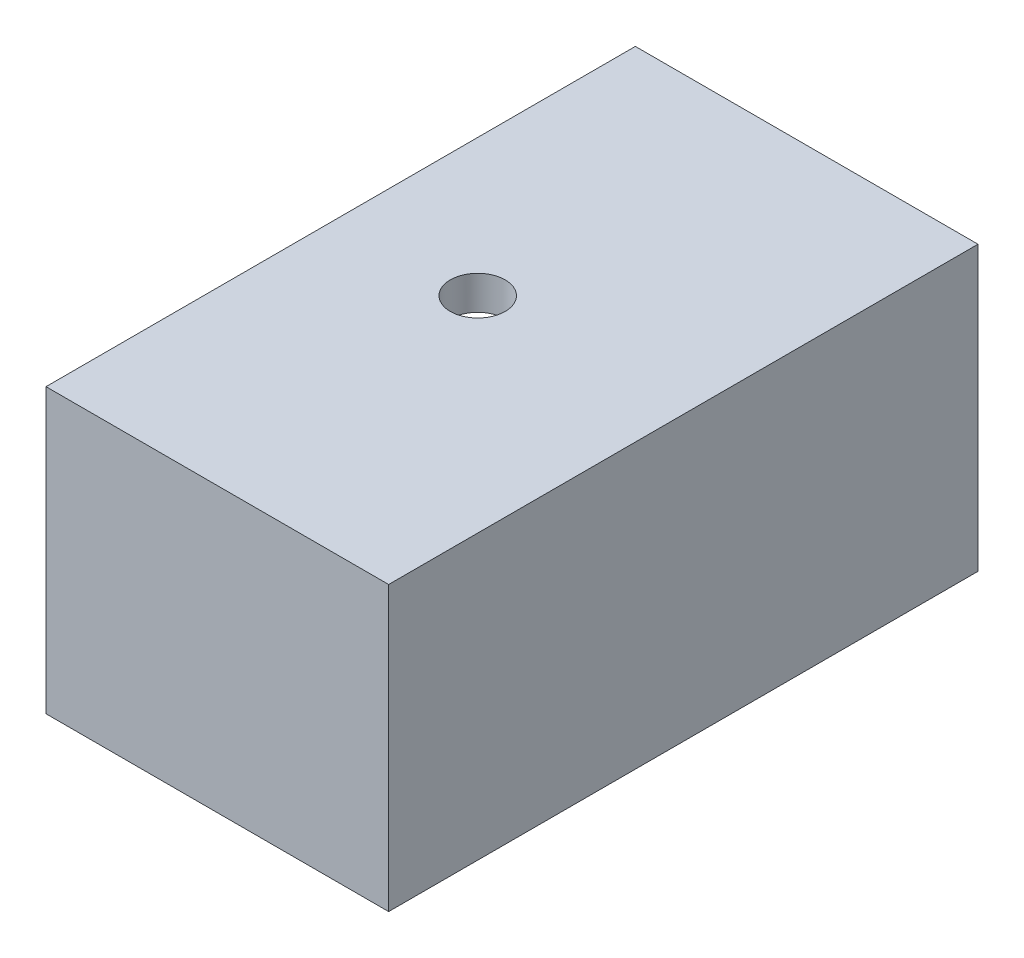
ISO-10303-21;
HEADER;
FILE_DESCRIPTION(('STEP AP214'),'2;1');
FILE_NAME('part.step','',(''),(''),'','','');
FILE_SCHEMA(('AUTOMOTIVE_DESIGN { 1 0 10303 214 1 1 1 1 }'));
ENDSEC;
DATA;
#1=APPLICATION_CONTEXT('core data for automotive mechanical design processes');
#2=APPLICATION_PROTOCOL_DEFINITION('international standard','automotive_design',2000,#1);
#3=PRODUCT_CONTEXT('',#1,'mechanical');
#4=PRODUCT('Part','Part','',(#3));
#5=PRODUCT_RELATED_PRODUCT_CATEGORY('part','',(#4));
#6=PRODUCT_DEFINITION_FORMATION('','',#4);
#7=PRODUCT_DEFINITION_CONTEXT('part definition',#1,'design');
#8=PRODUCT_DEFINITION('design','',#6,#7);
#9=PRODUCT_DEFINITION_SHAPE('','',#8);
#10=(LENGTH_UNIT() NAMED_UNIT(*) SI_UNIT(.MILLI.,.METRE.));
#11=(NAMED_UNIT(*) PLANE_ANGLE_UNIT() SI_UNIT($,.RADIAN.));
#12=(NAMED_UNIT(*) SI_UNIT($,.STERADIAN.) SOLID_ANGLE_UNIT());
#13=UNCERTAINTY_MEASURE_WITH_UNIT(LENGTH_MEASURE(1.E-05),#10,'distance_accuracy_value','');
#14=(GEOMETRIC_REPRESENTATION_CONTEXT(3) GLOBAL_UNCERTAINTY_ASSIGNED_CONTEXT((#13)) GLOBAL_UNIT_ASSIGNED_CONTEXT((#10,
#11,#12)) REPRESENTATION_CONTEXT('',''));
#15=CARTESIAN_POINT('',(0.,0.,0.));
#16=DIRECTION('',(0.,0.,1.));
#17=DIRECTION('',(1.,0.,0.));
#18=AXIS2_PLACEMENT_3D('',#15,#16,#17);
#19=CARTESIAN_POINT('',(12.5,20.67,21.5));
#20=DIRECTION('',(-1.,0.,0.));
#21=DIRECTION('',(0.,0.,1.));
#22=AXIS2_PLACEMENT_3D('',#19,#20,#21);
#23=PLANE('',#22);
#24=DIRECTION('',(0.,0.,-1.));
#25=VECTOR('',#24,1.);
#26=CARTESIAN_POINT('',(12.5,0.,21.5));
#27=LINE('',#26,#25);
#28=CARTESIAN_POINT('',(12.5,0.,21.5));
#29=VERTEX_POINT('',#28);
#30=CARTESIAN_POINT('',(12.5,0.,-21.5));
#31=VERTEX_POINT('',#30);
#32=EDGE_CURVE('E155',#29,#31,#27,.T.);
#33=ORIENTED_EDGE('',*,*,#32,.T.);
#34=DIRECTION('',(0.,-1.,0.));
#35=VECTOR('',#34,1.);
#36=CARTESIAN_POINT('',(12.5,20.67,-21.5));
#37=LINE('',#36,#35);
#38=CARTESIAN_POINT('',(12.5,20.67,-21.5));
#39=VERTEX_POINT('',#38);
#40=EDGE_CURVE('E11',#39,#31,#37,.T.);
#41=ORIENTED_EDGE('',*,*,#40,.F.);
#42=DIRECTION('',(0.,0.,-1.));
#43=VECTOR('',#42,1.);
#44=CARTESIAN_POINT('',(12.5,20.67,21.5));
#45=LINE('',#44,#43);
#46=CARTESIAN_POINT('',(12.5,20.67,21.5));
#47=VERTEX_POINT('',#46);
#48=EDGE_CURVE('E159',#47,#39,#45,.T.);
#49=ORIENTED_EDGE('',*,*,#48,.F.);
#50=DIRECTION('',(0.,-1.,0.));
#51=VECTOR('',#50,1.);
#52=CARTESIAN_POINT('',(12.5,20.67,21.5));
#53=LINE('',#52,#51);
#54=EDGE_CURVE('E165',#47,#29,#53,.T.);
#55=ORIENTED_EDGE('',*,*,#54,.T.);
#56=EDGE_LOOP('',(#33,#41,#49,#55));
#57=FACE_BOUND('',#56,.T.);
#58=ADVANCED_FACE('F43',(#57),#23,.F.);
#59=CARTESIAN_POINT('',(-12.5,20.67,-21.5));
#60=DIRECTION('',(0.,0.,1.));
#61=DIRECTION('',(1.,0.,0.));
#62=AXIS2_PLACEMENT_3D('',#59,#60,#61);
#63=PLANE('',#62);
#64=DIRECTION('',(-1.,0.,0.));
#65=VECTOR('',#64,1.);
#66=CARTESIAN_POINT('',(-12.5,0.,-21.5));
#67=LINE('',#66,#65);
#68=CARTESIAN_POINT('',(-12.5,0.,-21.5));
#69=VERTEX_POINT('',#68);
#70=EDGE_CURVE('E168',#31,#69,#67,.T.);
#71=ORIENTED_EDGE('',*,*,#70,.T.);
#72=DIRECTION('',(0.,-1.,0.));
#73=VECTOR('',#72,1.);
#74=CARTESIAN_POINT('',(-12.5,20.67,-21.5));
#75=LINE('',#74,#73);
#76=CARTESIAN_POINT('',(-12.5,20.67,-21.5));
#77=VERTEX_POINT('',#76);
#78=EDGE_CURVE('E51',#77,#69,#75,.T.);
#79=ORIENTED_EDGE('',*,*,#78,.F.);
#80=DIRECTION('',(-1.,0.,0.));
#81=VECTOR('',#80,1.);
#82=CARTESIAN_POINT('',(-12.5,20.67,-21.5));
#83=LINE('',#82,#81);
#84=EDGE_CURVE('E95',#39,#77,#83,.T.);
#85=ORIENTED_EDGE('',*,*,#84,.F.);
#86=ORIENTED_EDGE('',*,*,#40,.T.);
#87=EDGE_LOOP('',(#71,#79,#85,#86));
#88=FACE_BOUND('',#87,.T.);
#89=ADVANCED_FACE('F198',(#88),#63,.F.);
#90=CARTESIAN_POINT('',(-12.5,20.67,21.5));
#91=DIRECTION('',(1.,0.,0.));
#92=DIRECTION('',(0.,0.,-1.));
#93=AXIS2_PLACEMENT_3D('',#90,#91,#92);
#94=PLANE('',#93);
#95=DIRECTION('',(0.,0.,-1.));
#96=VECTOR('',#95,1.);
#97=CARTESIAN_POINT('',(-12.5,18.202929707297,-11.5));
#98=LINE('',#97,#96);
#99=CARTESIAN_POINT('',(-12.5,18.202929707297,11.5));
#100=VERTEX_POINT('',#99);
#101=CARTESIAN_POINT('',(-12.5,18.202929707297,-11.5));
#102=VERTEX_POINT('',#101);
#103=EDGE_CURVE('E149',#100,#102,#98,.T.);
#104=ORIENTED_EDGE('',*,*,#103,.F.);
#105=DIRECTION('',(0.,1.,0.));
#106=VECTOR('',#105,1.);
#107=CARTESIAN_POINT('',(-12.5,2.46707029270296,11.5));
#108=LINE('',#107,#106);
#109=CARTESIAN_POINT('',(-12.5,2.46707029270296,11.5));
#110=VERTEX_POINT('',#109);
#111=EDGE_CURVE('E58',#110,#100,#108,.T.);
#112=ORIENTED_EDGE('',*,*,#111,.F.);
#113=DIRECTION('',(0.,0.,1.));
#114=VECTOR('',#113,1.);
#115=CARTESIAN_POINT('',(-12.5,2.46707029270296,-11.5));
#116=LINE('',#115,#114);
#117=CARTESIAN_POINT('',(-12.5,2.46707029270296,-11.5));
#118=VERTEX_POINT('',#117);
#119=EDGE_CURVE('E137',#118,#110,#116,.T.);
#120=ORIENTED_EDGE('',*,*,#119,.F.);
#121=DIRECTION('',(0.,-1.,0.));
#122=VECTOR('',#121,1.);
#123=CARTESIAN_POINT('',(-12.5,2.46707029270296,-11.5));
#124=LINE('',#123,#122);
#125=EDGE_CURVE('E140',#102,#118,#124,.T.);
#126=ORIENTED_EDGE('',*,*,#125,.F.);
#127=EDGE_LOOP('',(#104,#112,#120,#126));
#128=FACE_BOUND('',#127,.T.);
#129=DIRECTION('',(0.,0.,1.));
#130=VECTOR('',#129,1.);
#131=CARTESIAN_POINT('',(-12.5,0.,21.5));
#132=LINE('',#131,#130);
#133=CARTESIAN_POINT('',(-12.5,0.,21.5));
#134=VERTEX_POINT('',#133);
#135=EDGE_CURVE('E170',#69,#134,#132,.T.);
#136=ORIENTED_EDGE('',*,*,#135,.T.);
#137=DIRECTION('',(0.,-1.,0.));
#138=VECTOR('',#137,1.);
#139=CARTESIAN_POINT('',(-12.5,20.67,21.5));
#140=LINE('',#139,#138);
#141=CARTESIAN_POINT('',(-12.5,20.67,21.5));
#142=VERTEX_POINT('',#141);
#143=EDGE_CURVE('E174',#142,#134,#140,.T.);
#144=ORIENTED_EDGE('',*,*,#143,.F.);
#145=DIRECTION('',(0.,0.,1.));
#146=VECTOR('',#145,1.);
#147=CARTESIAN_POINT('',(-12.5,20.67,21.5));
#148=LINE('',#147,#146);
#149=EDGE_CURVE('E162',#77,#142,#148,.T.);
#150=ORIENTED_EDGE('',*,*,#149,.F.);
#151=ORIENTED_EDGE('',*,*,#78,.T.);
#152=EDGE_LOOP('',(#136,#144,#150,#151));
#153=FACE_BOUND('',#152,.T.);
#154=ADVANCED_FACE('F180',(#128,#153),#94,.F.);
#155=CARTESIAN_POINT('',(-12.5,20.67,21.5));
#156=DIRECTION('',(0.,0.,-1.));
#157=DIRECTION('',(-1.,0.,0.));
#158=AXIS2_PLACEMENT_3D('',#155,#156,#157);
#159=PLANE('',#158);
#160=DIRECTION('',(1.,0.,0.));
#161=VECTOR('',#160,1.);
#162=CARTESIAN_POINT('',(-12.5,0.,21.5));
#163=LINE('',#162,#161);
#164=EDGE_CURVE('E88',#134,#29,#163,.T.);
#165=ORIENTED_EDGE('',*,*,#164,.T.);
#166=ORIENTED_EDGE('',*,*,#54,.F.);
#167=DIRECTION('',(1.,0.,0.));
#168=VECTOR('',#167,1.);
#169=CARTESIAN_POINT('',(-12.5,20.67,21.5));
#170=LINE('',#169,#168);
#171=EDGE_CURVE('E67',#142,#47,#170,.T.);
#172=ORIENTED_EDGE('',*,*,#171,.F.);
#173=ORIENTED_EDGE('',*,*,#143,.T.);
#174=EDGE_LOOP('',(#165,#166,#172,#173));
#175=FACE_BOUND('',#174,.T.);
#176=ADVANCED_FACE('F188',(#175),#159,.F.);
#177=CARTESIAN_POINT('',(0.,20.67,0.));
#178=DIRECTION('',(0.,-1.,0.));
#179=DIRECTION('',(0.,0.,-1.));
#180=AXIS2_PLACEMENT_3D('',#177,#178,#179);
#181=PLANE('',#180);
#182=CARTESIAN_POINT('',(-2.5,20.67,0.));
#183=DIRECTION('',(0.,-1.,0.));
#184=DIRECTION('',(0.,0.,-1.));
#185=AXIS2_PLACEMENT_3D('',#182,#183,#184);
#186=CIRCLE('',#185,2.);
#187=CARTESIAN_POINT('',(-2.5,20.67,-2.));
#188=VERTEX_POINT('',#187);
#189=EDGE_CURVE('E363',#188,#188,#186,.T.);
#190=ORIENTED_EDGE('',*,*,#189,.T.);
#191=EDGE_LOOP('',(#190));
#192=FACE_BOUND('',#191,.T.);
#193=ORIENTED_EDGE('',*,*,#48,.T.);
#194=ORIENTED_EDGE('',*,*,#84,.T.);
#195=ORIENTED_EDGE('',*,*,#149,.T.);
#196=ORIENTED_EDGE('',*,*,#171,.T.);
#197=EDGE_LOOP('',(#193,#194,#195,#196));
#198=FACE_BOUND('',#197,.T.);
#199=ADVANCED_FACE('F190',(#192,#198),#181,.F.);
#200=CARTESIAN_POINT('',(0.,0.,0.));
#201=DIRECTION('',(0.,-1.,0.));
#202=DIRECTION('',(0.,0.,-1.));
#203=AXIS2_PLACEMENT_3D('',#200,#201,#202);
#204=PLANE('',#203);
#205=CARTESIAN_POINT('',(-2.5,0.,0.));
#206=DIRECTION('',(0.,-1.,0.));
#207=DIRECTION('',(0.,0.,-1.));
#208=AXIS2_PLACEMENT_3D('',#205,#206,#207);
#209=CIRCLE('',#208,2.);
#210=CARTESIAN_POINT('',(-2.5,0.,-2.));
#211=VERTEX_POINT('',#210);
#212=EDGE_CURVE('E359',#211,#211,#209,.T.);
#213=ORIENTED_EDGE('',*,*,#212,.F.);
#214=EDGE_LOOP('',(#213));
#215=FACE_BOUND('',#214,.T.);
#216=ORIENTED_EDGE('',*,*,#32,.F.);
#217=ORIENTED_EDGE('',*,*,#164,.F.);
#218=ORIENTED_EDGE('',*,*,#135,.F.);
#219=ORIENTED_EDGE('',*,*,#70,.F.);
#220=EDGE_LOOP('',(#216,#217,#218,#219));
#221=FACE_BOUND('',#220,.T.);
#222=ADVANCED_FACE('F184',(#215,#221),#204,.T.);
#223=CARTESIAN_POINT('',(5.5,2.46707029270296,11.5));
#224=DIRECTION('',(0.,0.,1.));
#225=DIRECTION('',(1.,0.,0.));
#226=AXIS2_PLACEMENT_3D('',#223,#224,#225);
#227=PLANE('',#226);
#228=ORIENTED_EDGE('',*,*,#111,.T.);
#229=DIRECTION('',(-1.,0.,0.));
#230=VECTOR('',#229,1.);
#231=CARTESIAN_POINT('',(5.5,18.202929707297,11.5));
#232=LINE('',#231,#230);
#233=CARTESIAN_POINT('',(5.5,18.202929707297,11.5));
#234=VERTEX_POINT('',#233);
#235=EDGE_CURVE('E115',#234,#100,#232,.T.);
#236=ORIENTED_EDGE('',*,*,#235,.F.);
#237=DIRECTION('',(0.,1.,0.));
#238=VECTOR('',#237,1.);
#239=CARTESIAN_POINT('',(5.5,2.46707029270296,11.5));
#240=LINE('',#239,#238);
#241=CARTESIAN_POINT('',(5.5,2.46707029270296,11.5));
#242=VERTEX_POINT('',#241);
#243=EDGE_CURVE('E119',#242,#234,#240,.T.);
#244=ORIENTED_EDGE('',*,*,#243,.F.);
#245=DIRECTION('',(-1.,0.,0.));
#246=VECTOR('',#245,1.);
#247=CARTESIAN_POINT('',(5.5,2.46707029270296,11.5));
#248=LINE('',#247,#246);
#249=EDGE_CURVE('E153',#242,#110,#248,.T.);
#250=ORIENTED_EDGE('',*,*,#249,.T.);
#251=EDGE_LOOP('',(#228,#236,#244,#250));
#252=FACE_BOUND('',#251,.T.);
#253=ADVANCED_FACE('F117',(#252),#227,.F.);
#254=CARTESIAN_POINT('',(5.5,2.46707029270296,-11.5));
#255=DIRECTION('',(0.,-1.,0.));
#256=DIRECTION('',(0.,0.,-1.));
#257=AXIS2_PLACEMENT_3D('',#254,#255,#256);
#258=PLANE('',#257);
#259=CARTESIAN_POINT('',(-2.5,2.46707029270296,0.));
#260=DIRECTION('',(0.,-1.,0.));
#261=DIRECTION('',(0.,0.,-1.));
#262=AXIS2_PLACEMENT_3D('',#259,#260,#261);
#263=CIRCLE('',#262,2.);
#264=CARTESIAN_POINT('',(-2.5,2.46707029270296,-2.));
#265=VERTEX_POINT('',#264);
#266=EDGE_CURVE('E143',#265,#265,#263,.T.);
#267=ORIENTED_EDGE('',*,*,#266,.T.);
#268=EDGE_LOOP('',(#267));
#269=FACE_BOUND('',#268,.T.);
#270=ORIENTED_EDGE('',*,*,#119,.T.);
#271=ORIENTED_EDGE('',*,*,#249,.F.);
#272=DIRECTION('',(0.,0.,1.));
#273=VECTOR('',#272,1.);
#274=CARTESIAN_POINT('',(5.5,2.46707029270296,-11.5));
#275=LINE('',#274,#273);
#276=CARTESIAN_POINT('',(5.5,2.46707029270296,-11.5));
#277=VERTEX_POINT('',#276);
#278=EDGE_CURVE('E125',#277,#242,#275,.T.);
#279=ORIENTED_EDGE('',*,*,#278,.F.);
#280=DIRECTION('',(-1.,0.,0.));
#281=VECTOR('',#280,1.);
#282=CARTESIAN_POINT('',(5.5,2.46707029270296,-11.5));
#283=LINE('',#282,#281);
#284=EDGE_CURVE('E156',#277,#118,#283,.T.);
#285=ORIENTED_EDGE('',*,*,#284,.T.);
#286=EDGE_LOOP('',(#270,#271,#279,#285));
#287=FACE_BOUND('',#286,.T.);
#288=ADVANCED_FACE('F241',(#269,#287),#258,.F.);
#289=CARTESIAN_POINT('',(5.5,2.46707029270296,-11.5));
#290=DIRECTION('',(0.,0.,-1.));
#291=DIRECTION('',(-1.,0.,0.));
#292=AXIS2_PLACEMENT_3D('',#289,#290,#291);
#293=PLANE('',#292);
#294=ORIENTED_EDGE('',*,*,#125,.T.);
#295=ORIENTED_EDGE('',*,*,#284,.F.);
#296=DIRECTION('',(0.,-1.,0.));
#297=VECTOR('',#296,1.);
#298=CARTESIAN_POINT('',(5.5,2.46707029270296,-11.5));
#299=LINE('',#298,#297);
#300=CARTESIAN_POINT('',(5.5,18.202929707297,-11.5));
#301=VERTEX_POINT('',#300);
#302=EDGE_CURVE('E133',#301,#277,#299,.T.);
#303=ORIENTED_EDGE('',*,*,#302,.F.);
#304=DIRECTION('',(-1.,0.,0.));
#305=VECTOR('',#304,1.);
#306=CARTESIAN_POINT('',(5.5,18.202929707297,-11.5));
#307=LINE('',#306,#305);
#308=EDGE_CURVE('E124',#301,#102,#307,.T.);
#309=ORIENTED_EDGE('',*,*,#308,.T.);
#310=EDGE_LOOP('',(#294,#295,#303,#309));
#311=FACE_BOUND('',#310,.T.);
#312=ADVANCED_FACE('F250',(#311),#293,.F.);
#313=CARTESIAN_POINT('',(5.5,18.202929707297,-11.5));
#314=DIRECTION('',(0.,1.,0.));
#315=DIRECTION('',(0.,0.,1.));
#316=AXIS2_PLACEMENT_3D('',#313,#314,#315);
#317=PLANE('',#316);
#318=CARTESIAN_POINT('',(-2.5,18.202929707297,0.));
#319=DIRECTION('',(0.,1.,0.));
#320=DIRECTION('',(0.,0.,1.));
#321=AXIS2_PLACEMENT_3D('',#318,#319,#320);
#322=CIRCLE('',#321,2.);
#323=CARTESIAN_POINT('',(-2.5,18.202929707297,2.));
#324=VERTEX_POINT('',#323);
#325=EDGE_CURVE('E46',#324,#324,#322,.T.);
#326=ORIENTED_EDGE('',*,*,#325,.T.);
#327=EDGE_LOOP('',(#326));
#328=FACE_BOUND('',#327,.T.);
#329=ORIENTED_EDGE('',*,*,#103,.T.);
#330=ORIENTED_EDGE('',*,*,#308,.F.);
#331=DIRECTION('',(0.,0.,-1.));
#332=VECTOR('',#331,1.);
#333=CARTESIAN_POINT('',(5.5,18.202929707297,-11.5));
#334=LINE('',#333,#332);
#335=EDGE_CURVE('E128',#234,#301,#334,.T.);
#336=ORIENTED_EDGE('',*,*,#335,.F.);
#337=ORIENTED_EDGE('',*,*,#235,.T.);
#338=EDGE_LOOP('',(#329,#330,#336,#337));
#339=FACE_BOUND('',#338,.T.);
#340=ADVANCED_FACE('F129',(#328,#339),#317,.F.);
#341=CARTESIAN_POINT('',(5.5,0.,0.));
#342=DIRECTION('',(1.,0.,0.));
#343=DIRECTION('',(0.,0.,-1.));
#344=AXIS2_PLACEMENT_3D('',#341,#342,#343);
#345=PLANE('',#344);
#346=ORIENTED_EDGE('',*,*,#243,.T.);
#347=ORIENTED_EDGE('',*,*,#335,.T.);
#348=ORIENTED_EDGE('',*,*,#302,.T.);
#349=ORIENTED_EDGE('',*,*,#278,.T.);
#350=EDGE_LOOP('',(#346,#347,#348,#349));
#351=FACE_BOUND('',#350,.T.);
#352=ADVANCED_FACE('F135',(#351),#345,.F.);
#353=CARTESIAN_POINT('',(-2.5,20.67,0.));
#354=DIRECTION('',(0.,-1.,0.));
#355=DIRECTION('',(0.,0.,-1.));
#356=AXIS2_PLACEMENT_3D('',#353,#354,#355);
#357=CYLINDRICAL_SURFACE('',#356,2.);
#358=ORIENTED_EDGE('',*,*,#189,.F.);
#359=EDGE_LOOP('',(#358));
#360=FACE_BOUND('',#359,.T.);
#361=ORIENTED_EDGE('',*,*,#325,.F.);
#362=EDGE_LOOP('',(#361));
#363=FACE_BOUND('',#362,.T.);
#364=ADVANCED_FACE('F277',(#360,#363),#357,.F.);
#365=ORIENTED_EDGE('',*,*,#212,.T.);
#366=EDGE_LOOP('',(#365));
#367=FACE_BOUND('',#366,.T.);
#368=ORIENTED_EDGE('',*,*,#266,.F.);
#369=EDGE_LOOP('',(#368));
#370=FACE_BOUND('',#369,.T.);
#371=ADVANCED_FACE('F285',(#367,#370),#357,.F.);
#372=CLOSED_SHELL('',(#58,#89,#154,#176,#199,#222,#253,#288,#312,#340,#352,#364,#371));
#373=MANIFOLD_SOLID_BREP('B2',#372);
#374=ADVANCED_BREP_SHAPE_REPRESENTATION('',(#18,#373),#14);
#375=SHAPE_DEFINITION_REPRESENTATION(#9,#374);
ENDSEC;
END-ISO-10303-21;
